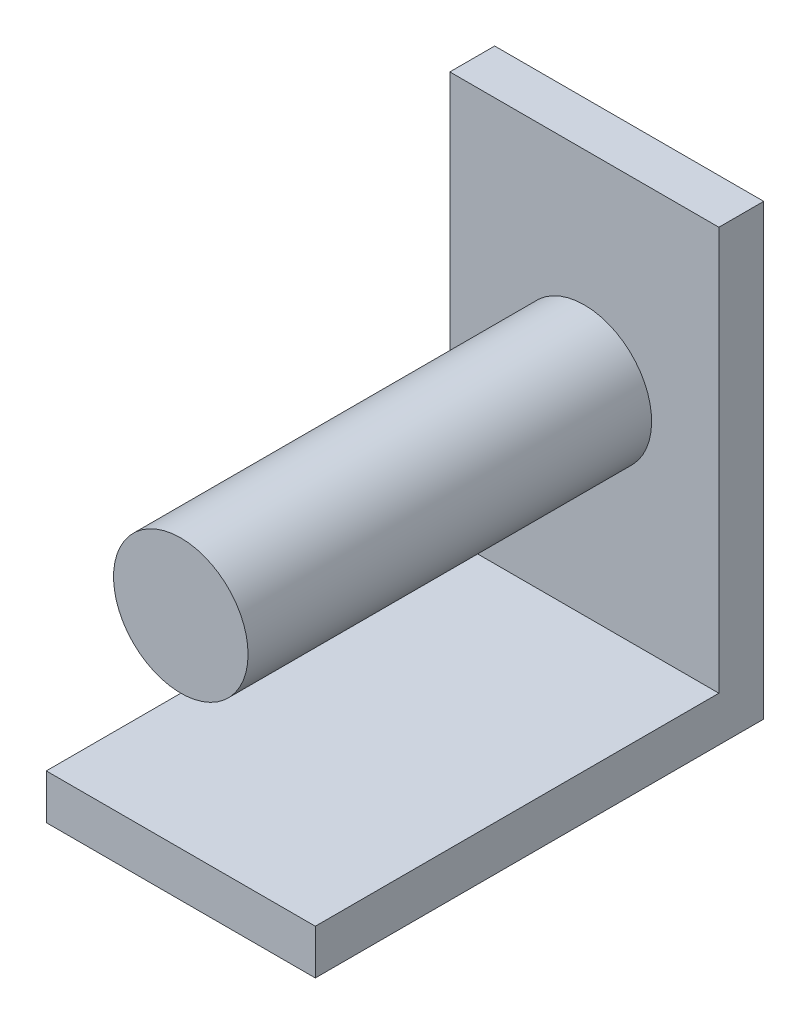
ISO-10303-21;
HEADER;
FILE_DESCRIPTION(('STEP AP214'),'2;1');
FILE_NAME('part.step','',(''),(''),'','','');
FILE_SCHEMA(('AUTOMOTIVE_DESIGN { 1 0 10303 214 1 1 1 1 }'));
ENDSEC;
DATA;
#1=APPLICATION_CONTEXT('core data for automotive mechanical design processes');
#2=APPLICATION_PROTOCOL_DEFINITION('international standard','automotive_design',2000,#1);
#3=PRODUCT_CONTEXT('',#1,'mechanical');
#4=PRODUCT('Part','Part','',(#3));
#5=PRODUCT_RELATED_PRODUCT_CATEGORY('part','',(#4));
#6=PRODUCT_DEFINITION_FORMATION('','',#4);
#7=PRODUCT_DEFINITION_CONTEXT('part definition',#1,'design');
#8=PRODUCT_DEFINITION('design','',#6,#7);
#9=PRODUCT_DEFINITION_SHAPE('','',#8);
#10=(LENGTH_UNIT() NAMED_UNIT(*) SI_UNIT(.MILLI.,.METRE.));
#11=(NAMED_UNIT(*) PLANE_ANGLE_UNIT() SI_UNIT($,.RADIAN.));
#12=(NAMED_UNIT(*) SI_UNIT($,.STERADIAN.) SOLID_ANGLE_UNIT());
#13=UNCERTAINTY_MEASURE_WITH_UNIT(LENGTH_MEASURE(1.E-05),#10,'distance_accuracy_value','');
#14=(GEOMETRIC_REPRESENTATION_CONTEXT(3) GLOBAL_UNCERTAINTY_ASSIGNED_CONTEXT((#13)) GLOBAL_UNIT_ASSIGNED_CONTEXT((#10,
#11,#12)) REPRESENTATION_CONTEXT('',''));
#15=CARTESIAN_POINT('',(0.,0.,0.));
#16=DIRECTION('',(0.,0.,1.));
#17=DIRECTION('',(1.,0.,0.));
#18=AXIS2_PLACEMENT_3D('',#15,#16,#17);
#19=CARTESIAN_POINT('',(15.,50.,-45.));
#20=DIRECTION('',(0.,0.,-1.));
#21=DIRECTION('',(0.,1.,0.));
#22=AXIS2_PLACEMENT_3D('',#19,#20,#21);
#23=PLANE('',#22);
#24=DIRECTION('',(0.,-1.,0.));
#25=VECTOR('',#24,1.);
#26=CARTESIAN_POINT('',(-15.,50.,-45.));
#27=LINE('',#26,#25);
#28=CARTESIAN_POINT('',(-15.,50.,-45.));
#29=VERTEX_POINT('',#28);
#30=CARTESIAN_POINT('',(-15.,5.,-45.));
#31=VERTEX_POINT('',#30);
#32=EDGE_CURVE('E114',#29,#31,#27,.T.);
#33=ORIENTED_EDGE('',*,*,#32,.T.);
#34=DIRECTION('',(-1.,0.,0.));
#35=VECTOR('',#34,1.);
#36=CARTESIAN_POINT('',(15.,5.,-45.));
#37=LINE('',#36,#35);
#38=CARTESIAN_POINT('',(15.,5.,-45.));
#39=VERTEX_POINT('',#38);
#40=EDGE_CURVE('E128',#39,#31,#37,.T.);
#41=ORIENTED_EDGE('',*,*,#40,.F.);
#42=DIRECTION('',(0.,-1.,0.));
#43=VECTOR('',#42,1.);
#44=CARTESIAN_POINT('',(15.,50.,-45.));
#45=LINE('',#44,#43);
#46=CARTESIAN_POINT('',(15.,50.,-45.));
#47=VERTEX_POINT('',#46);
#48=EDGE_CURVE('E53',#47,#39,#45,.T.);
#49=ORIENTED_EDGE('',*,*,#48,.F.);
#50=DIRECTION('',(-1.,0.,0.));
#51=VECTOR('',#50,1.);
#52=CARTESIAN_POINT('',(15.,50.,-45.));
#53=LINE('',#52,#51);
#54=EDGE_CURVE('E131',#47,#29,#53,.T.);
#55=ORIENTED_EDGE('',*,*,#54,.T.);
#56=EDGE_LOOP('',(#33,#41,#49,#55));
#57=FACE_BOUND('',#56,.T.);
#58=CARTESIAN_POINT('',(0.,27.5,-45.));
#59=DIRECTION('',(0.,0.,-1.));
#60=DIRECTION('',(0.,1.,0.));
#61=AXIS2_PLACEMENT_3D('',#58,#59,#60);
#62=CIRCLE('',#61,7.5);
#63=CARTESIAN_POINT('',(0.,35.,-45.));
#64=VERTEX_POINT('',#63);
#65=EDGE_CURVE('E11',#64,#64,#62,.F.);
#66=ORIENTED_EDGE('',*,*,#65,.F.);
#67=EDGE_LOOP('',(#66));
#68=FACE_BOUND('',#67,.T.);
#69=ADVANCED_FACE('F33',(#57,#68),#23,.F.);
#70=CARTESIAN_POINT('',(15.,5.,0.));
#71=DIRECTION('',(0.,0.,-1.));
#72=DIRECTION('',(0.,1.,0.));
#73=AXIS2_PLACEMENT_3D('',#70,#71,#72);
#74=PLANE('',#73);
#75=DIRECTION('',(0.,-1.,0.));
#76=VECTOR('',#75,1.);
#77=CARTESIAN_POINT('',(-15.,5.,0.));
#78=LINE('',#77,#76);
#79=CARTESIAN_POINT('',(-15.,5.,0.));
#80=VERTEX_POINT('',#79);
#81=CARTESIAN_POINT('',(-15.,0.,0.));
#82=VERTEX_POINT('',#81);
#83=EDGE_CURVE('E91',#80,#82,#78,.T.);
#84=ORIENTED_EDGE('',*,*,#83,.T.);
#85=DIRECTION('',(-1.,0.,0.));
#86=VECTOR('',#85,1.);
#87=CARTESIAN_POINT('',(15.,0.,0.));
#88=LINE('',#87,#86);
#89=CARTESIAN_POINT('',(15.,0.,0.));
#90=VERTEX_POINT('',#89);
#91=EDGE_CURVE('E41',#90,#82,#88,.T.);
#92=ORIENTED_EDGE('',*,*,#91,.F.);
#93=DIRECTION('',(0.,-1.,0.));
#94=VECTOR('',#93,1.);
#95=CARTESIAN_POINT('',(15.,5.,0.));
#96=LINE('',#95,#94);
#97=CARTESIAN_POINT('',(15.,5.,0.));
#98=VERTEX_POINT('',#97);
#99=EDGE_CURVE('E118',#98,#90,#96,.T.);
#100=ORIENTED_EDGE('',*,*,#99,.F.);
#101=DIRECTION('',(-1.,0.,0.));
#102=VECTOR('',#101,1.);
#103=CARTESIAN_POINT('',(15.,5.,0.));
#104=LINE('',#103,#102);
#105=EDGE_CURVE('E105',#98,#80,#104,.T.);
#106=ORIENTED_EDGE('',*,*,#105,.T.);
#107=EDGE_LOOP('',(#84,#92,#100,#106));
#108=FACE_BOUND('',#107,.T.);
#109=ADVANCED_FACE('F35',(#108),#74,.F.);
#110=CARTESIAN_POINT('',(15.,0.,0.));
#111=DIRECTION('',(0.,1.,0.));
#112=DIRECTION('',(0.,0.,1.));
#113=AXIS2_PLACEMENT_3D('',#110,#111,#112);
#114=PLANE('',#113);
#115=DIRECTION('',(0.,0.,-1.));
#116=VECTOR('',#115,1.);
#117=CARTESIAN_POINT('',(-15.,0.,0.));
#118=LINE('',#117,#116);
#119=CARTESIAN_POINT('',(-15.,0.,-50.));
#120=VERTEX_POINT('',#119);
#121=EDGE_CURVE('E86',#82,#120,#118,.T.);
#122=ORIENTED_EDGE('',*,*,#121,.T.);
#123=DIRECTION('',(-1.,0.,0.));
#124=VECTOR('',#123,1.);
#125=CARTESIAN_POINT('',(15.,0.,-50.));
#126=LINE('',#125,#124);
#127=CARTESIAN_POINT('',(15.,0.,-50.));
#128=VERTEX_POINT('',#127);
#129=EDGE_CURVE('E103',#128,#120,#126,.T.);
#130=ORIENTED_EDGE('',*,*,#129,.F.);
#131=DIRECTION('',(0.,0.,-1.));
#132=VECTOR('',#131,1.);
#133=CARTESIAN_POINT('',(15.,0.,0.));
#134=LINE('',#133,#132);
#135=EDGE_CURVE('E100',#90,#128,#134,.T.);
#136=ORIENTED_EDGE('',*,*,#135,.F.);
#137=ORIENTED_EDGE('',*,*,#91,.T.);
#138=EDGE_LOOP('',(#122,#130,#136,#137));
#139=FACE_BOUND('',#138,.T.);
#140=ADVANCED_FACE('F99',(#139),#114,.F.);
#141=CARTESIAN_POINT('',(15.,0.,-50.));
#142=DIRECTION('',(0.,0.,1.));
#143=DIRECTION('',(1.,0.,0.));
#144=AXIS2_PLACEMENT_3D('',#141,#142,#143);
#145=PLANE('',#144);
#146=DIRECTION('',(0.,1.,0.));
#147=VECTOR('',#146,1.);
#148=CARTESIAN_POINT('',(-15.,0.,-50.));
#149=LINE('',#148,#147);
#150=CARTESIAN_POINT('',(-15.,50.,-50.));
#151=VERTEX_POINT('',#150);
#152=EDGE_CURVE('E93',#120,#151,#149,.T.);
#153=ORIENTED_EDGE('',*,*,#152,.T.);
#154=DIRECTION('',(-1.,0.,0.));
#155=VECTOR('',#154,1.);
#156=CARTESIAN_POINT('',(15.,50.,-50.));
#157=LINE('',#156,#155);
#158=CARTESIAN_POINT('',(15.,50.,-50.));
#159=VERTEX_POINT('',#158);
#160=EDGE_CURVE('E134',#159,#151,#157,.T.);
#161=ORIENTED_EDGE('',*,*,#160,.F.);
#162=DIRECTION('',(0.,1.,0.));
#163=VECTOR('',#162,1.);
#164=CARTESIAN_POINT('',(15.,0.,-50.));
#165=LINE('',#164,#163);
#166=EDGE_CURVE('E121',#128,#159,#165,.T.);
#167=ORIENTED_EDGE('',*,*,#166,.F.);
#168=ORIENTED_EDGE('',*,*,#129,.T.);
#169=EDGE_LOOP('',(#153,#161,#167,#168));
#170=FACE_BOUND('',#169,.T.);
#171=ADVANCED_FACE('F139',(#170),#145,.F.);
#172=CARTESIAN_POINT('',(15.,50.,-50.));
#173=DIRECTION('',(0.,-1.,0.));
#174=DIRECTION('',(0.,0.,-1.));
#175=AXIS2_PLACEMENT_3D('',#172,#173,#174);
#176=PLANE('',#175);
#177=DIRECTION('',(0.,0.,1.));
#178=VECTOR('',#177,1.);
#179=CARTESIAN_POINT('',(-15.,50.,-50.));
#180=LINE('',#179,#178);
#181=EDGE_CURVE('E112',#151,#29,#180,.T.);
#182=ORIENTED_EDGE('',*,*,#181,.T.);
#183=ORIENTED_EDGE('',*,*,#54,.F.);
#184=DIRECTION('',(0.,0.,1.));
#185=VECTOR('',#184,1.);
#186=CARTESIAN_POINT('',(15.,50.,-50.));
#187=LINE('',#186,#185);
#188=EDGE_CURVE('E123',#159,#47,#187,.T.);
#189=ORIENTED_EDGE('',*,*,#188,.F.);
#190=ORIENTED_EDGE('',*,*,#160,.T.);
#191=EDGE_LOOP('',(#182,#183,#189,#190));
#192=FACE_BOUND('',#191,.T.);
#193=ADVANCED_FACE('F145',(#192),#176,.F.);
#194=CARTESIAN_POINT('',(15.,5.,-45.));
#195=DIRECTION('',(0.,-1.,0.));
#196=DIRECTION('',(0.,0.,-1.));
#197=AXIS2_PLACEMENT_3D('',#194,#195,#196);
#198=PLANE('',#197);
#199=DIRECTION('',(0.,0.,1.));
#200=VECTOR('',#199,1.);
#201=CARTESIAN_POINT('',(-15.,5.,-45.));
#202=LINE('',#201,#200);
#203=EDGE_CURVE('E116',#31,#80,#202,.T.);
#204=ORIENTED_EDGE('',*,*,#203,.T.);
#205=ORIENTED_EDGE('',*,*,#105,.F.);
#206=DIRECTION('',(0.,0.,1.));
#207=VECTOR('',#206,1.);
#208=CARTESIAN_POINT('',(15.,5.,-45.));
#209=LINE('',#208,#207);
#210=EDGE_CURVE('E48',#39,#98,#209,.T.);
#211=ORIENTED_EDGE('',*,*,#210,.F.);
#212=ORIENTED_EDGE('',*,*,#40,.T.);
#213=EDGE_LOOP('',(#204,#205,#211,#212));
#214=FACE_BOUND('',#213,.T.);
#215=ADVANCED_FACE('F150',(#214),#198,.F.);
#216=CARTESIAN_POINT('',(15.,0.,0.));
#217=DIRECTION('',(1.,0.,0.));
#218=DIRECTION('',(0.,0.,-1.));
#219=AXIS2_PLACEMENT_3D('',#216,#217,#218);
#220=PLANE('',#219);
#221=ORIENTED_EDGE('',*,*,#99,.T.);
#222=ORIENTED_EDGE('',*,*,#135,.T.);
#223=ORIENTED_EDGE('',*,*,#166,.T.);
#224=ORIENTED_EDGE('',*,*,#188,.T.);
#225=ORIENTED_EDGE('',*,*,#48,.T.);
#226=ORIENTED_EDGE('',*,*,#210,.T.);
#227=EDGE_LOOP('',(#221,#222,#223,#224,#225,#226));
#228=FACE_BOUND('',#227,.T.);
#229=ADVANCED_FACE('F142',(#228),#220,.T.);
#230=CARTESIAN_POINT('',(-15.,0.,0.));
#231=DIRECTION('',(1.,0.,0.));
#232=DIRECTION('',(0.,0.,-1.));
#233=AXIS2_PLACEMENT_3D('',#230,#231,#232);
#234=PLANE('',#233);
#235=ORIENTED_EDGE('',*,*,#83,.F.);
#236=ORIENTED_EDGE('',*,*,#203,.F.);
#237=ORIENTED_EDGE('',*,*,#32,.F.);
#238=ORIENTED_EDGE('',*,*,#181,.F.);
#239=ORIENTED_EDGE('',*,*,#152,.F.);
#240=ORIENTED_EDGE('',*,*,#121,.F.);
#241=EDGE_LOOP('',(#235,#236,#237,#238,#239,#240));
#242=FACE_BOUND('',#241,.T.);
#243=ADVANCED_FACE('F88',(#242),#234,.F.);
#244=CARTESIAN_POINT('',(0.,27.5,0.));
#245=DIRECTION('',(0.,0.,-1.));
#246=DIRECTION('',(-1.,0.,0.));
#247=AXIS2_PLACEMENT_3D('',#244,#245,#246);
#248=CYLINDRICAL_SURFACE('',#247,7.5);
#249=CARTESIAN_POINT('',(0.,27.5,0.));
#250=DIRECTION('',(0.,0.,1.));
#251=DIRECTION('',(1.,0.,0.));
#252=AXIS2_PLACEMENT_3D('',#249,#250,#251);
#253=CIRCLE('',#252,7.5);
#254=CARTESIAN_POINT('',(7.5,27.5,0.));
#255=VERTEX_POINT('',#254);
#256=EDGE_CURVE('E106',#255,#255,#253,.T.);
#257=ORIENTED_EDGE('',*,*,#256,.F.);
#258=EDGE_LOOP('',(#257));
#259=FACE_BOUND('',#258,.T.);
#260=ORIENTED_EDGE('',*,*,#65,.T.);
#261=EDGE_LOOP('',(#260));
#262=FACE_BOUND('',#261,.T.);
#263=ADVANCED_FACE('F197',(#259,#262),#248,.T.);
#264=CARTESIAN_POINT('',(0.,27.5,0.));
#265=DIRECTION('',(0.,0.,1.));
#266=DIRECTION('',(1.,0.,0.));
#267=AXIS2_PLACEMENT_3D('',#264,#265,#266);
#268=PLANE('',#267);
#269=ORIENTED_EDGE('',*,*,#256,.T.);
#270=EDGE_LOOP('',(#269));
#271=FACE_BOUND('',#270,.T.);
#272=ADVANCED_FACE('F211',(#271),#268,.T.);
#273=CLOSED_SHELL('',(#69,#109,#140,#171,#193,#215,#229,#243,#263,#272));
#274=MANIFOLD_SOLID_BREP('B2',#273);
#275=ADVANCED_BREP_SHAPE_REPRESENTATION('',(#18,#274),#14);
#276=SHAPE_DEFINITION_REPRESENTATION(#9,#275);
ENDSEC;
END-ISO-10303-21;
